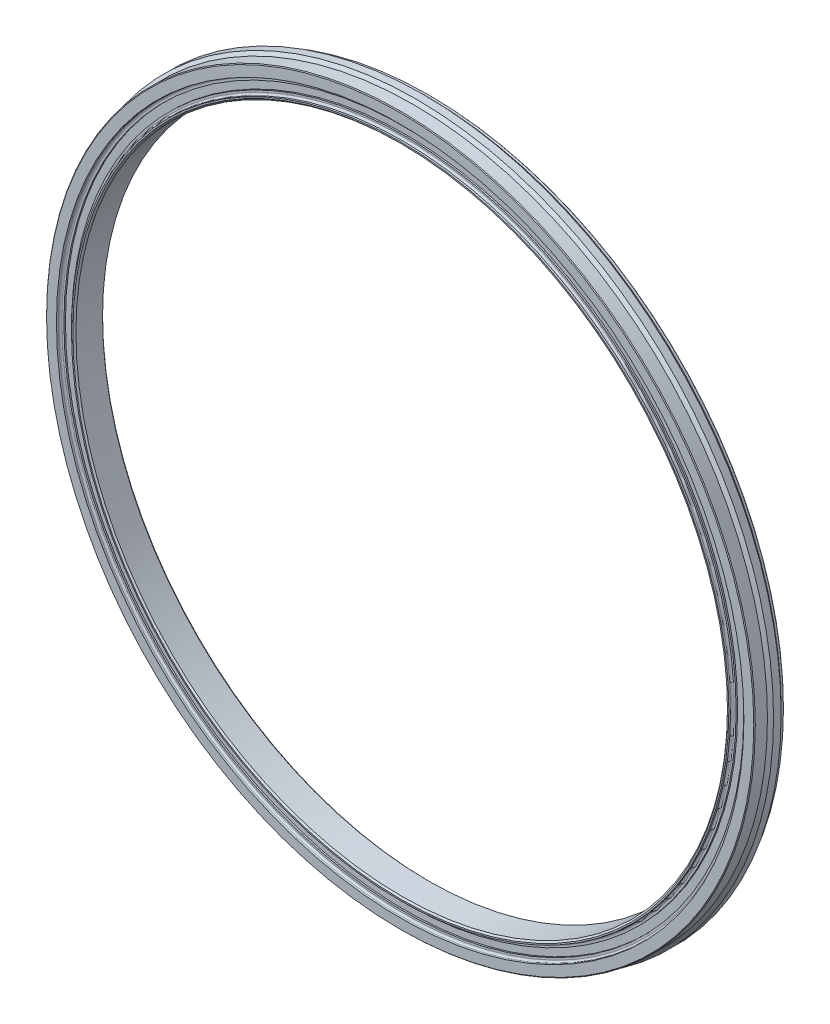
ISO-10303-21;
HEADER;
FILE_DESCRIPTION(('STEP AP214'),'2;1');
FILE_NAME('part.step','',(''),(''),'','','');
FILE_SCHEMA(('AUTOMOTIVE_DESIGN { 1 0 10303 214 1 1 1 1 }'));
ENDSEC;
DATA;
#1=APPLICATION_CONTEXT('core data for automotive mechanical design processes');
#2=APPLICATION_PROTOCOL_DEFINITION('international standard','automotive_design',2000,#1);
#3=PRODUCT_CONTEXT('',#1,'mechanical');
#4=PRODUCT('Part','Part','',(#3));
#5=PRODUCT_RELATED_PRODUCT_CATEGORY('part','',(#4));
#6=PRODUCT_DEFINITION_FORMATION('','',#4);
#7=PRODUCT_DEFINITION_CONTEXT('part definition',#1,'design');
#8=PRODUCT_DEFINITION('design','',#6,#7);
#9=PRODUCT_DEFINITION_SHAPE('','',#8);
#10=(LENGTH_UNIT() NAMED_UNIT(*) SI_UNIT(.MILLI.,.METRE.));
#11=(NAMED_UNIT(*) PLANE_ANGLE_UNIT() SI_UNIT($,.RADIAN.));
#12=(NAMED_UNIT(*) SI_UNIT($,.STERADIAN.) SOLID_ANGLE_UNIT());
#13=UNCERTAINTY_MEASURE_WITH_UNIT(LENGTH_MEASURE(1.E-05),#10,'distance_accuracy_value','');
#14=(GEOMETRIC_REPRESENTATION_CONTEXT(3) GLOBAL_UNCERTAINTY_ASSIGNED_CONTEXT((#13)) GLOBAL_UNIT_ASSIGNED_CONTEXT((#10,
#11,#12)) REPRESENTATION_CONTEXT('',''));
#15=CARTESIAN_POINT('',(0.,0.,0.));
#16=DIRECTION('',(0.,0.,1.));
#17=DIRECTION('',(1.,0.,0.));
#18=AXIS2_PLACEMENT_3D('',#15,#16,#17);
#19=CARTESIAN_POINT('',(0.,0.,17.1));
#20=DIRECTION('',(0.,0.,1.));
#21=DIRECTION('',(1.,0.,0.));
#22=AXIS2_PLACEMENT_3D('',#19,#20,#21);
#23=PLANE('',#22);
#24=CARTESIAN_POINT('',(0.,0.,17.0999999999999));
#25=DIRECTION('',(0.,0.,-1.));
#26=DIRECTION('',(1.,0.,0.));
#27=AXIS2_PLACEMENT_3D('',#24,#25,#26);
#28=CIRCLE('',#27,224.8);
#29=CARTESIAN_POINT('',(-224.8,0.,17.0999999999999));
#30=VERTEX_POINT('',#29);
#31=CARTESIAN_POINT('',(224.8,0.,17.0999999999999));
#32=VERTEX_POINT('',#31);
#33=EDGE_CURVE('E82',#30,#32,#28,.F.);
#34=ORIENTED_EDGE('',*,*,#33,.T.);
#35=CARTESIAN_POINT('',(0.,0.,17.0999999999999));
#36=DIRECTION('',(0.,0.,-1.));
#37=DIRECTION('',(-1.,0.,0.));
#38=AXIS2_PLACEMENT_3D('',#35,#36,#37);
#39=CIRCLE('',#38,224.8);
#40=EDGE_CURVE('E79',#32,#30,#39,.F.);
#41=ORIENTED_EDGE('',*,*,#40,.T.);
#42=EDGE_LOOP('',(#34,#41));
#43=FACE_BOUND('',#42,.T.);
#44=CARTESIAN_POINT('',(0.,0.,17.1));
#45=DIRECTION('',(0.,0.,1.));
#46=DIRECTION('',(1.,0.,0.));
#47=AXIS2_PLACEMENT_3D('',#44,#45,#46);
#48=CIRCLE('',#47,223.5);
#49=CARTESIAN_POINT('',(223.5,0.,17.1));
#50=VERTEX_POINT('',#49);
#51=EDGE_CURVE('E86',#50,#50,#48,.F.);
#52=ORIENTED_EDGE('',*,*,#51,.T.);
#53=EDGE_LOOP('',(#52));
#54=FACE_BOUND('',#53,.T.);
#55=ADVANCED_FACE('F16',(#43,#54),#23,.T.);
#56=CARTESIAN_POINT('',(0.,0.,-0.975000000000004));
#57=DIRECTION('',(0.,0.,1.));
#58=DIRECTION('',(1.,0.,0.));
#59=AXIS2_PLACEMENT_3D('',#56,#57,#58);
#60=CYLINDRICAL_SURFACE('',#59,223.5);
#61=ORIENTED_EDGE('',*,*,#51,.F.);
#62=EDGE_LOOP('',(#61));
#63=FACE_BOUND('',#62,.T.);
#64=CARTESIAN_POINT('',(0.,0.,16.1));
#65=DIRECTION('',(0.,0.,1.));
#66=DIRECTION('',(1.,0.,0.));
#67=AXIS2_PLACEMENT_3D('',#64,#65,#66);
#68=CIRCLE('',#67,223.5);
#69=CARTESIAN_POINT('',(223.5,0.,16.1));
#70=VERTEX_POINT('',#69);
#71=EDGE_CURVE('E91',#70,#70,#68,.T.);
#72=ORIENTED_EDGE('',*,*,#71,.F.);
#73=EDGE_LOOP('',(#72));
#74=FACE_BOUND('',#73,.T.);
#75=ADVANCED_FACE('F117',(#63,#74),#60,.F.);
#76=CARTESIAN_POINT('',(0.,0.,18.2999999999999));
#77=DIRECTION('',(0.,0.,1.));
#78=DIRECTION('',(-1.,0.,0.));
#79=AXIS2_PLACEMENT_3D('',#76,#77,#78);
#80=TOROIDAL_SURFACE('',#79,224.8,1.2);
#81=CARTESIAN_POINT('',(0.,0.,18.3));
#82=DIRECTION('',(0.,0.,1.));
#83=DIRECTION('',(1.,0.,0.));
#84=AXIS2_PLACEMENT_3D('',#81,#82,#83);
#85=CIRCLE('',#84,226.);
#86=CARTESIAN_POINT('',(226.,0.,18.3));
#87=VERTEX_POINT('',#86);
#88=EDGE_CURVE('E123',#87,#87,#85,.T.);
#89=ORIENTED_EDGE('',*,*,#88,.T.);
#90=EDGE_LOOP('',(#89));
#91=FACE_BOUND('',#90,.T.);
#92=ORIENTED_EDGE('',*,*,#33,.F.);
#93=ORIENTED_EDGE('',*,*,#40,.F.);
#94=EDGE_LOOP('',(#92,#93));
#95=FACE_BOUND('',#94,.T.);
#96=ADVANCED_FACE('F83',(#91,#95),#80,.F.);
#97=CARTESIAN_POINT('',(0.,0.,16.1));
#98=DIRECTION('',(0.,0.,1.));
#99=DIRECTION('',(1.,0.,0.));
#100=AXIS2_PLACEMENT_3D('',#97,#98,#99);
#101=PLANE('',#100);
#102=ORIENTED_EDGE('',*,*,#71,.T.);
#103=EDGE_LOOP('',(#102));
#104=FACE_BOUND('',#103,.T.);
#105=CARTESIAN_POINT('',(0.,0.,16.1));
#106=DIRECTION('',(0.,0.,1.));
#107=DIRECTION('',(1.,0.,0.));
#108=AXIS2_PLACEMENT_3D('',#105,#106,#107);
#109=CIRCLE('',#108,218.5);
#110=CARTESIAN_POINT('',(218.5,0.,16.1));
#111=VERTEX_POINT('',#110);
#112=EDGE_CURVE('E127',#111,#111,#109,.T.);
#113=ORIENTED_EDGE('',*,*,#112,.F.);
#114=EDGE_LOOP('',(#113));
#115=FACE_BOUND('',#114,.T.);
#116=ADVANCED_FACE('F116',(#104,#115),#101,.T.);
#117=CARTESIAN_POINT('',(0.,0.,-0.975000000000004));
#118=DIRECTION('',(0.,0.,1.));
#119=DIRECTION('',(1.,0.,0.));
#120=AXIS2_PLACEMENT_3D('',#117,#118,#119);
#121=CYLINDRICAL_SURFACE('',#120,226.);
#122=ORIENTED_EDGE('',*,*,#88,.F.);
#123=EDGE_LOOP('',(#122));
#124=FACE_BOUND('',#123,.T.);
#125=CARTESIAN_POINT('',(0.,0.,19.5));
#126=DIRECTION('',(0.,0.,1.));
#127=DIRECTION('',(1.,0.,0.));
#128=AXIS2_PLACEMENT_3D('',#125,#126,#127);
#129=CIRCLE('',#128,226.);
#130=CARTESIAN_POINT('',(226.,0.,19.5));
#131=VERTEX_POINT('',#130);
#132=EDGE_CURVE('E379',#131,#131,#129,.F.);
#133=ORIENTED_EDGE('',*,*,#132,.F.);
#134=EDGE_LOOP('',(#133));
#135=FACE_BOUND('',#134,.T.);
#136=ADVANCED_FACE('F192',(#124,#135),#121,.F.);
#137=CARTESIAN_POINT('',(0.,0.,-0.975000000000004));
#138=DIRECTION('',(0.,0.,1.));
#139=DIRECTION('',(1.,0.,0.));
#140=AXIS2_PLACEMENT_3D('',#137,#138,#139);
#141=CYLINDRICAL_SURFACE('',#140,218.5);
#142=ORIENTED_EDGE('',*,*,#112,.T.);
#143=EDGE_LOOP('',(#142));
#144=FACE_BOUND('',#143,.T.);
#145=CARTESIAN_POINT('',(0.,0.,17.1));
#146=DIRECTION('',(0.,0.,1.));
#147=DIRECTION('',(1.,0.,0.));
#148=AXIS2_PLACEMENT_3D('',#145,#146,#147);
#149=CIRCLE('',#148,218.5);
#150=CARTESIAN_POINT('',(218.5,0.,17.1));
#151=VERTEX_POINT('',#150);
#152=EDGE_CURVE('E375',#151,#151,#149,.T.);
#153=ORIENTED_EDGE('',*,*,#152,.F.);
#154=EDGE_LOOP('',(#153));
#155=FACE_BOUND('',#154,.T.);
#156=ADVANCED_FACE('F189',(#144,#155),#141,.T.);
#157=CARTESIAN_POINT('',(0.,0.,19.5));
#158=DIRECTION('',(0.,0.,1.));
#159=DIRECTION('',(1.,0.,0.));
#160=AXIS2_PLACEMENT_3D('',#157,#158,#159);
#161=PLANE('',#160);
#162=CARTESIAN_POINT('',(0.,0.,19.5));
#163=DIRECTION('',(0.,0.,-1.));
#164=DIRECTION('',(-1.,0.,0.));
#165=AXIS2_PLACEMENT_3D('',#162,#163,#164);
#166=CIRCLE('',#165,232.5);
#167=CARTESIAN_POINT('',(-232.5,0.,19.5));
#168=VERTEX_POINT('',#167);
#169=EDGE_CURVE('E371',#168,#168,#166,.T.);
#170=ORIENTED_EDGE('',*,*,#169,.F.);
#171=EDGE_LOOP('',(#170));
#172=FACE_BOUND('',#171,.T.);
#173=ORIENTED_EDGE('',*,*,#132,.T.);
#174=EDGE_LOOP('',(#173));
#175=FACE_BOUND('',#174,.T.);
#176=ADVANCED_FACE('F177',(#172,#175),#161,.T.);
#177=CARTESIAN_POINT('',(0.,0.,17.1));
#178=DIRECTION('',(0.,0.,1.));
#179=DIRECTION('',(1.,0.,0.));
#180=AXIS2_PLACEMENT_3D('',#177,#178,#179);
#181=PLANE('',#180);
#182=ORIENTED_EDGE('',*,*,#152,.T.);
#183=EDGE_LOOP('',(#182));
#184=FACE_BOUND('',#183,.T.);
#185=CARTESIAN_POINT('',(0.,0.,17.0999999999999));
#186=DIRECTION('',(0.,0.,1.));
#187=DIRECTION('',(1.,0.,0.));
#188=AXIS2_PLACEMENT_3D('',#185,#186,#187);
#189=CIRCLE('',#188,217.3);
#190=CARTESIAN_POINT('',(-217.3,0.,17.0999999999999));
#191=VERTEX_POINT('',#190);
#192=CARTESIAN_POINT('',(217.3,0.,17.0999999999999));
#193=VERTEX_POINT('',#192);
#194=EDGE_CURVE('E164',#191,#193,#189,.F.);
#195=ORIENTED_EDGE('',*,*,#194,.T.);
#196=CARTESIAN_POINT('',(0.,0.,17.0999999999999));
#197=DIRECTION('',(0.,0.,1.));
#198=DIRECTION('',(-1.,0.,0.));
#199=AXIS2_PLACEMENT_3D('',#196,#197,#198);
#200=CIRCLE('',#199,217.3);
#201=EDGE_CURVE('E160',#193,#191,#200,.F.);
#202=ORIENTED_EDGE('',*,*,#201,.T.);
#203=EDGE_LOOP('',(#195,#202));
#204=FACE_BOUND('',#203,.T.);
#205=ADVANCED_FACE('F168',(#184,#204),#181,.T.);
#206=CARTESIAN_POINT('',(0.,0.,19.));
#207=DIRECTION('',(0.,0.,-1.));
#208=DIRECTION('',(-1.,0.,0.));
#209=AXIS2_PLACEMENT_3D('',#206,#207,#208);
#210=CONICAL_SURFACE('',#209,233.,0.785398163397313);
#211=CARTESIAN_POINT('',(0.,0.,19.));
#212=DIRECTION('',(0.,0.,1.));
#213=DIRECTION('',(1.,0.,0.));
#214=AXIS2_PLACEMENT_3D('',#211,#212,#213);
#215=CIRCLE('',#214,233.);
#216=CARTESIAN_POINT('',(233.,0.,19.));
#217=VERTEX_POINT('',#216);
#218=EDGE_CURVE('E156',#217,#217,#215,.F.);
#219=ORIENTED_EDGE('',*,*,#218,.F.);
#220=EDGE_LOOP('',(#219));
#221=FACE_BOUND('',#220,.T.);
#222=ORIENTED_EDGE('',*,*,#169,.T.);
#223=EDGE_LOOP('',(#222));
#224=FACE_BOUND('',#223,.T.);
#225=ADVANCED_FACE('F146',(#221,#224),#210,.T.);
#226=CARTESIAN_POINT('',(0.,0.,18.2999999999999));
#227=DIRECTION('',(0.,0.,1.));
#228=DIRECTION('',(-1.,0.,0.));
#229=AXIS2_PLACEMENT_3D('',#226,#227,#228);
#230=TOROIDAL_SURFACE('',#229,217.3,1.2);
#231=CARTESIAN_POINT('',(0.,0.,18.3));
#232=DIRECTION('',(0.,0.,1.));
#233=DIRECTION('',(1.,0.,0.));
#234=AXIS2_PLACEMENT_3D('',#231,#232,#233);
#235=CIRCLE('',#234,216.1);
#236=CARTESIAN_POINT('',(216.1,0.,18.3));
#237=VERTEX_POINT('',#236);
#238=EDGE_CURVE('E154',#237,#237,#235,.T.);
#239=ORIENTED_EDGE('',*,*,#238,.F.);
#240=EDGE_LOOP('',(#239));
#241=FACE_BOUND('',#240,.T.);
#242=ORIENTED_EDGE('',*,*,#201,.F.);
#243=ORIENTED_EDGE('',*,*,#194,.F.);
#244=EDGE_LOOP('',(#242,#243));
#245=FACE_BOUND('',#244,.T.);
#246=ADVANCED_FACE('F134',(#241,#245),#230,.F.);
#247=CARTESIAN_POINT('',(0.,0.,-0.975000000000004));
#248=DIRECTION('',(0.,0.,1.));
#249=DIRECTION('',(1.,0.,0.));
#250=AXIS2_PLACEMENT_3D('',#247,#248,#249);
#251=CYLINDRICAL_SURFACE('',#250,233.);
#252=ORIENTED_EDGE('',*,*,#218,.T.);
#253=EDGE_LOOP('',(#252));
#254=FACE_BOUND('',#253,.T.);
#255=CARTESIAN_POINT('',(0.,0.,11.0000000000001));
#256=DIRECTION('',(0.,0.,-1.));
#257=DIRECTION('',(-1.,0.,0.));
#258=AXIS2_PLACEMENT_3D('',#255,#256,#257);
#259=CIRCLE('',#258,233.);
#260=CARTESIAN_POINT('',(-233.,0.,11.0000000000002));
#261=VERTEX_POINT('',#260);
#262=EDGE_CURVE('E357',#261,#261,#259,.T.);
#263=ORIENTED_EDGE('',*,*,#262,.F.);
#264=EDGE_LOOP('',(#263));
#265=FACE_BOUND('',#264,.T.);
#266=ADVANCED_FACE('F145',(#254,#265),#251,.T.);
#267=CARTESIAN_POINT('',(0.,0.,-0.975000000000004));
#268=DIRECTION('',(0.,0.,1.));
#269=DIRECTION('',(1.,0.,0.));
#270=AXIS2_PLACEMENT_3D('',#267,#268,#269);
#271=CYLINDRICAL_SURFACE('',#270,216.1);
#272=ORIENTED_EDGE('',*,*,#238,.T.);
#273=EDGE_LOOP('',(#272));
#274=FACE_BOUND('',#273,.T.);
#275=CARTESIAN_POINT('',(0.,0.,19.5));
#276=DIRECTION('',(0.,0.,1.));
#277=DIRECTION('',(1.,0.,0.));
#278=AXIS2_PLACEMENT_3D('',#275,#276,#277);
#279=CIRCLE('',#278,216.1);
#280=CARTESIAN_POINT('',(216.1,0.,19.5));
#281=VERTEX_POINT('',#280);
#282=EDGE_CURVE('E354',#281,#281,#279,.T.);
#283=ORIENTED_EDGE('',*,*,#282,.F.);
#284=EDGE_LOOP('',(#283));
#285=FACE_BOUND('',#284,.T.);
#286=ADVANCED_FACE('F341',(#274,#285),#271,.T.);
#287=CARTESIAN_POINT('',(0.,0.,9.00000000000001));
#288=DIRECTION('',(0.,0.,-1.));
#289=DIRECTION('',(-1.,0.,0.));
#290=AXIS2_PLACEMENT_3D('',#287,#288,#289);
#291=CONICAL_SURFACE('',#290,235.,0.785398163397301);
#292=CARTESIAN_POINT('',(0.,0.,9.00000000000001));
#293=DIRECTION('',(0.,0.,1.));
#294=DIRECTION('',(1.,0.,0.));
#295=AXIS2_PLACEMENT_3D('',#292,#293,#294);
#296=CIRCLE('',#295,235.);
#297=CARTESIAN_POINT('',(235.,0.,9.00000000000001));
#298=VERTEX_POINT('',#297);
#299=EDGE_CURVE('E356',#298,#298,#296,.F.);
#300=ORIENTED_EDGE('',*,*,#299,.F.);
#301=EDGE_LOOP('',(#300));
#302=FACE_BOUND('',#301,.T.);
#303=ORIENTED_EDGE('',*,*,#262,.T.);
#304=EDGE_LOOP('',(#303));
#305=FACE_BOUND('',#304,.T.);
#306=ADVANCED_FACE('F338',(#302,#305),#291,.T.);
#307=CARTESIAN_POINT('',(0.,0.,19.5));
#308=DIRECTION('',(0.,0.,1.));
#309=DIRECTION('',(1.,0.,0.));
#310=AXIS2_PLACEMENT_3D('',#307,#308,#309);
#311=PLANE('',#310);
#312=ORIENTED_EDGE('',*,*,#282,.T.);
#313=EDGE_LOOP('',(#312));
#314=FACE_BOUND('',#313,.T.);
#315=CARTESIAN_POINT('',(0.,0.,19.5000000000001));
#316=DIRECTION('',(0.,0.,1.));
#317=DIRECTION('',(0.,-1.,0.));
#318=AXIS2_PLACEMENT_3D('',#315,#316,#317);
#319=CIRCLE('',#318,215.2);
#320=CARTESIAN_POINT('',(0.,-215.2,19.5000000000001));
#321=VERTEX_POINT('',#320);
#322=EDGE_CURVE('E364',#321,#321,#319,.F.);
#323=ORIENTED_EDGE('',*,*,#322,.T.);
#324=EDGE_LOOP('',(#323));
#325=FACE_BOUND('',#324,.T.);
#326=ADVANCED_FACE('F334',(#314,#325),#311,.T.);
#327=CARTESIAN_POINT('',(0.,0.,-0.975000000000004));
#328=DIRECTION('',(0.,0.,1.));
#329=DIRECTION('',(1.,0.,0.));
#330=AXIS2_PLACEMENT_3D('',#327,#328,#329);
#331=CYLINDRICAL_SURFACE('',#330,235.);
#332=ORIENTED_EDGE('',*,*,#299,.T.);
#333=EDGE_LOOP('',(#332));
#334=FACE_BOUND('',#333,.T.);
#335=CARTESIAN_POINT('',(0.,0.,4.00000000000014));
#336=DIRECTION('',(0.,0.,1.));
#337=DIRECTION('',(1.,0.,0.));
#338=AXIS2_PLACEMENT_3D('',#335,#336,#337);
#339=CIRCLE('',#338,235.);
#340=CARTESIAN_POINT('',(235.,0.,4.00000000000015));
#341=VERTEX_POINT('',#340);
#342=EDGE_CURVE('E421',#341,#341,#339,.F.);
#343=ORIENTED_EDGE('',*,*,#342,.F.);
#344=EDGE_LOOP('',(#343));
#345=FACE_BOUND('',#344,.T.);
#346=ADVANCED_FACE('F330',(#334,#345),#331,.T.);
#347=CARTESIAN_POINT('',(0.,0.,19.5000000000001));
#348=DIRECTION('',(0.,0.,1.));
#349=DIRECTION('',(0.,-1.,0.));
#350=AXIS2_PLACEMENT_3D('',#347,#348,#349);
#351=CONICAL_SURFACE('',#350,215.2,0.785398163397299);
#352=CARTESIAN_POINT('',(0.,0.,18.5));
#353=DIRECTION('',(0.,0.,1.));
#354=DIRECTION('',(1.,0.,0.));
#355=AXIS2_PLACEMENT_3D('',#352,#353,#354);
#356=CIRCLE('',#355,214.2);
#357=CARTESIAN_POINT('',(214.2,0.,18.5));
#358=VERTEX_POINT('',#357);
#359=EDGE_CURVE('E407',#358,#358,#356,.F.);
#360=ORIENTED_EDGE('',*,*,#359,.T.);
#361=EDGE_LOOP('',(#360));
#362=FACE_BOUND('',#361,.T.);
#363=ORIENTED_EDGE('',*,*,#322,.F.);
#364=EDGE_LOOP('',(#363));
#365=FACE_BOUND('',#364,.T.);
#366=ADVANCED_FACE('F326',(#362,#365),#351,.F.);
#367=CARTESIAN_POINT('',(0.,0.,4.00000000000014));
#368=DIRECTION('',(0.,0.,1.));
#369=DIRECTION('',(1.,0.,0.));
#370=AXIS2_PLACEMENT_3D('',#367,#368,#369);
#371=CONICAL_SURFACE('',#370,235.,0.785398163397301);
#372=ORIENTED_EDGE('',*,*,#342,.T.);
#373=EDGE_LOOP('',(#372));
#374=FACE_BOUND('',#373,.T.);
#375=CARTESIAN_POINT('',(0.,0.,2.));
#376=DIRECTION('',(0.,0.,1.));
#377=DIRECTION('',(1.,0.,0.));
#378=AXIS2_PLACEMENT_3D('',#375,#376,#377);
#379=CIRCLE('',#378,233.);
#380=CARTESIAN_POINT('',(233.,0.,2.));
#381=VERTEX_POINT('',#380);
#382=EDGE_CURVE('E403',#381,#381,#379,.F.);
#383=ORIENTED_EDGE('',*,*,#382,.F.);
#384=EDGE_LOOP('',(#383));
#385=FACE_BOUND('',#384,.T.);
#386=ADVANCED_FACE('F322',(#374,#385),#371,.T.);
#387=CARTESIAN_POINT('',(194.8557158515,-112.5,12.4978484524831));
#388=DIRECTION('',(0.,0.,-1.));
#389=DIRECTION('',(-1.,0.,0.));
#390=AXIS2_PLACEMENT_3D('',#387,#388,#389);
#391=CONICAL_SURFACE('',#390,2.49999999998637,1.02974425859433);
#392=CARTESIAN_POINT('',(194.8557158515,-112.5,14.0000000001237));
#393=VERTEX_POINT('',#392);
#394=VERTEX_LOOP('',#393);
#395=FACE_BOUND('',#394,.T.);
#396=CARTESIAN_POINT('',(194.8557158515,-112.5,12.49784845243));
#397=DIRECTION('',(0.,0.,-1.));
#398=DIRECTION('',(-1.,0.,0.));
#399=AXIS2_PLACEMENT_3D('',#396,#397,#398);
#400=CIRCLE('',#399,2.5);
#401=CARTESIAN_POINT('',(192.3557158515,-112.5,12.49784845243));
#402=VERTEX_POINT('',#401);
#403=EDGE_CURVE('E406',#402,#402,#400,.T.);
#404=ORIENTED_EDGE('',*,*,#403,.T.);
#405=EDGE_LOOP('',(#404));
#406=FACE_BOUND('',#405,.T.);
#407=ADVANCED_FACE('F318',(#395,#406),#391,.F.);
#408=CARTESIAN_POINT('',(112.5,-194.8557158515,12.4978484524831));
#409=DIRECTION('',(0.,0.,-1.));
#410=DIRECTION('',(0.,1.,0.));
#411=AXIS2_PLACEMENT_3D('',#408,#409,#410);
#412=CONICAL_SURFACE('',#411,2.49999999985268,1.02974425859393);
#413=CARTESIAN_POINT('',(112.5,-194.8557158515,14.0000000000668));
#414=VERTEX_POINT('',#413);
#415=VERTEX_LOOP('',#414);
#416=FACE_BOUND('',#415,.T.);
#417=CARTESIAN_POINT('',(112.5,-194.8557158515,12.49784845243));
#418=DIRECTION('',(0.,0.,-1.));
#419=DIRECTION('',(-1.,0.,0.));
#420=AXIS2_PLACEMENT_3D('',#417,#418,#419);
#421=CIRCLE('',#420,2.5);
#422=CARTESIAN_POINT('',(110.,-194.8557158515,12.49784845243));
#423=VERTEX_POINT('',#422);
#424=EDGE_CURVE('E510',#423,#423,#421,.T.);
#425=ORIENTED_EDGE('',*,*,#424,.T.);
#426=EDGE_LOOP('',(#425));
#427=FACE_BOUND('',#426,.T.);
#428=ADVANCED_FACE('F314',(#416,#427),#412,.F.);
#429=CARTESIAN_POINT('',(0.,-225.,12.49784845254));
#430=DIRECTION('',(0.,0.,-1.));
#431=DIRECTION('',(0.,1.,0.));
#432=AXIS2_PLACEMENT_3D('',#429,#430,#431);
#433=CONICAL_SURFACE('',#432,2.49999999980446,1.0297442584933);
#434=CARTESIAN_POINT('',(0.,-225.,14.0000000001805));
#435=VERTEX_POINT('',#434);
#436=VERTEX_LOOP('',#435);
#437=FACE_BOUND('',#436,.T.);
#438=CARTESIAN_POINT('',(0.,-225.,12.49784845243));
#439=DIRECTION('',(0.,0.,-1.));
#440=DIRECTION('',(-1.,0.,0.));
#441=AXIS2_PLACEMENT_3D('',#438,#439,#440);
#442=CIRCLE('',#441,2.5);
#443=CARTESIAN_POINT('',(-2.5,-225.,12.49784845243));
#444=VERTEX_POINT('',#443);
#445=EDGE_CURVE('E513',#444,#444,#442,.T.);
#446=ORIENTED_EDGE('',*,*,#445,.T.);
#447=EDGE_LOOP('',(#446));
#448=FACE_BOUND('',#447,.T.);
#449=ADVANCED_FACE('F310',(#437,#448),#433,.F.);
#450=CARTESIAN_POINT('',(-112.5,-194.8557158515,12.4978484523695));
#451=DIRECTION('',(0.,0.,-1.));
#452=DIRECTION('',(0.,1.,0.));
#453=AXIS2_PLACEMENT_3D('',#450,#451,#452);
#454=CONICAL_SURFACE('',#453,2.50000000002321,1.02974425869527);
#455=CARTESIAN_POINT('',(-112.5,-194.8557158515,13.9999999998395));
#456=VERTEX_POINT('',#455);
#457=VERTEX_LOOP('',#456);
#458=FACE_BOUND('',#457,.T.);
#459=CARTESIAN_POINT('',(-112.5,-194.8557158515,12.49784845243));
#460=DIRECTION('',(0.,0.,-1.));
#461=DIRECTION('',(-1.,0.,0.));
#462=AXIS2_PLACEMENT_3D('',#459,#460,#461);
#463=CIRCLE('',#462,2.5);
#464=CARTESIAN_POINT('',(-115.,-194.8557158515,12.49784845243));
#465=VERTEX_POINT('',#464);
#466=EDGE_CURVE('E516',#465,#465,#463,.T.);
#467=ORIENTED_EDGE('',*,*,#466,.T.);
#468=EDGE_LOOP('',(#467));
#469=FACE_BOUND('',#468,.T.);
#470=ADVANCED_FACE('F306',(#458,#469),#454,.F.);
#471=CARTESIAN_POINT('',(-194.8557158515,-112.5,12.4978484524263));
#472=DIRECTION('',(0.,0.,-1.));
#473=DIRECTION('',(-1.,0.,0.));
#474=AXIS2_PLACEMENT_3D('',#471,#472,#473);
#475=CONICAL_SURFACE('',#474,2.49999999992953,1.02974425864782);
#476=CARTESIAN_POINT('',(-194.8557158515,-112.5,14.00000000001));
#477=VERTEX_POINT('',#476);
#478=VERTEX_LOOP('',#477);
#479=FACE_BOUND('',#478,.T.);
#480=CARTESIAN_POINT('',(-194.8557158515,-112.5,12.49784845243));
#481=DIRECTION('',(0.,0.,-1.));
#482=DIRECTION('',(-1.,0.,0.));
#483=AXIS2_PLACEMENT_3D('',#480,#481,#482);
#484=CIRCLE('',#483,2.5);
#485=CARTESIAN_POINT('',(-197.3557158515,-112.5,12.49784845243));
#486=VERTEX_POINT('',#485);
#487=EDGE_CURVE('E519',#486,#486,#484,.T.);
#488=ORIENTED_EDGE('',*,*,#487,.T.);
#489=EDGE_LOOP('',(#488));
#490=FACE_BOUND('',#489,.T.);
#491=ADVANCED_FACE('F302',(#479,#490),#475,.F.);
#492=CARTESIAN_POINT('',(-225.,0.,12.4978484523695));
#493=DIRECTION('',(0.,0.,-1.));
#494=DIRECTION('',(0.,1.,0.));
#495=AXIS2_PLACEMENT_3D('',#492,#493,#494);
#496=CONICAL_SURFACE('',#495,2.49999999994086,1.0297442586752);
#497=CARTESIAN_POINT('',(-225.,0.,13.9999999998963));
#498=VERTEX_POINT('',#497);
#499=VERTEX_LOOP('',#498);
#500=FACE_BOUND('',#499,.T.);
#501=CARTESIAN_POINT('',(-225.,0.,12.49784845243));
#502=DIRECTION('',(0.,0.,-1.));
#503=DIRECTION('',(-1.,0.,0.));
#504=AXIS2_PLACEMENT_3D('',#501,#502,#503);
#505=CIRCLE('',#504,2.5);
#506=CARTESIAN_POINT('',(-227.5,0.,12.49784845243));
#507=VERTEX_POINT('',#506);
#508=EDGE_CURVE('E419',#507,#507,#505,.T.);
#509=ORIENTED_EDGE('',*,*,#508,.T.);
#510=EDGE_LOOP('',(#509));
#511=FACE_BOUND('',#510,.T.);
#512=ADVANCED_FACE('F298',(#500,#511),#496,.F.);
#513=CARTESIAN_POINT('',(-194.8557158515,112.5,12.4978484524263));
#514=DIRECTION('',(0.,0.,-1.));
#515=DIRECTION('',(-1.,0.,0.));
#516=AXIS2_PLACEMENT_3D('',#513,#514,#515);
#517=CONICAL_SURFACE('',#516,2.49999999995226,1.02974425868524);
#518=CARTESIAN_POINT('',(-194.8557158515,112.5,13.9999999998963));
#519=VERTEX_POINT('',#518);
#520=VERTEX_LOOP('',#519);
#521=FACE_BOUND('',#520,.T.);
#522=CARTESIAN_POINT('',(-194.8557158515,112.5,12.49784845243));
#523=DIRECTION('',(0.,0.,-1.));
#524=DIRECTION('',(-1.,0.,0.));
#525=AXIS2_PLACEMENT_3D('',#522,#523,#524);
#526=CIRCLE('',#525,2.5);
#527=CARTESIAN_POINT('',(-197.3557158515,112.5,12.49784845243));
#528=VERTEX_POINT('',#527);
#529=EDGE_CURVE('E415',#528,#528,#526,.T.);
#530=ORIENTED_EDGE('',*,*,#529,.T.);
#531=EDGE_LOOP('',(#530));
#532=FACE_BOUND('',#531,.T.);
#533=ADVANCED_FACE('F294',(#521,#532),#517,.F.);
#534=CARTESIAN_POINT('',(-112.5,194.8557158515,12.4978484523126));
#535=DIRECTION('',(0.,0.,-1.));
#536=DIRECTION('',(0.,1.,0.));
#537=AXIS2_PLACEMENT_3D('',#534,#535,#536);
#538=CONICAL_SURFACE('',#537,2.50000000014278,1.02974425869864);
#539=CARTESIAN_POINT('',(-112.5,194.8557158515,13.9999999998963));
#540=VERTEX_POINT('',#539);
#541=VERTEX_LOOP('',#540);
#542=FACE_BOUND('',#541,.T.);
#543=CARTESIAN_POINT('',(-112.5,194.8557158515,12.49784845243));
#544=DIRECTION('',(0.,0.,-1.));
#545=DIRECTION('',(-1.,0.,0.));
#546=AXIS2_PLACEMENT_3D('',#543,#544,#545);
#547=CIRCLE('',#546,2.5);
#548=CARTESIAN_POINT('',(-115.,194.8557158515,12.49784845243));
#549=VERTEX_POINT('',#548);
#550=EDGE_CURVE('E418',#549,#549,#547,.T.);
#551=ORIENTED_EDGE('',*,*,#550,.T.);
#552=EDGE_LOOP('',(#551));
#553=FACE_BOUND('',#552,.T.);
#554=ADVANCED_FACE('F290',(#542,#553),#538,.F.);
#555=CARTESIAN_POINT('',(0.,225.,12.4978484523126));
#556=DIRECTION('',(0.,0.,-1.));
#557=DIRECTION('',(0.,1.,0.));
#558=AXIS2_PLACEMENT_3D('',#555,#556,#557);
#559=CONICAL_SURFACE('',#558,2.5000000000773,1.02974425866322);
#560=CARTESIAN_POINT('',(0.,225.,13.9999999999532));
#561=VERTEX_POINT('',#560);
#562=VERTEX_LOOP('',#561);
#563=FACE_BOUND('',#562,.T.);
#564=CARTESIAN_POINT('',(0.,225.,12.49784845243));
#565=DIRECTION('',(0.,0.,-1.));
#566=DIRECTION('',(-1.,0.,0.));
#567=AXIS2_PLACEMENT_3D('',#564,#565,#566);
#568=CIRCLE('',#567,2.5);
#569=CARTESIAN_POINT('',(-2.5,225.,12.49784845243));
#570=VERTEX_POINT('',#569);
#571=EDGE_CURVE('E526',#570,#570,#568,.T.);
#572=ORIENTED_EDGE('',*,*,#571,.T.);
#573=EDGE_LOOP('',(#572));
#574=FACE_BOUND('',#573,.T.);
#575=ADVANCED_FACE('F286',(#563,#574),#559,.F.);
#576=CARTESIAN_POINT('',(112.5,194.8557158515,12.4978484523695));
#577=DIRECTION('',(0.,0.,-1.));
#578=DIRECTION('',(0.,1.,0.));
#579=AXIS2_PLACEMENT_3D('',#576,#577,#578);
#580=CONICAL_SURFACE('',#579,2.50000000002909,1.02974425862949);
#581=CARTESIAN_POINT('',(112.5,194.8557158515,14.0000000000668));
#582=VERTEX_POINT('',#581);
#583=VERTEX_LOOP('',#582);
#584=FACE_BOUND('',#583,.T.);
#585=CARTESIAN_POINT('',(112.5,194.8557158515,12.49784845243));
#586=DIRECTION('',(0.,0.,-1.));
#587=DIRECTION('',(-1.,0.,0.));
#588=AXIS2_PLACEMENT_3D('',#585,#586,#587);
#589=CIRCLE('',#588,2.5);
#590=CARTESIAN_POINT('',(110.,194.8557158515,12.49784845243));
#591=VERTEX_POINT('',#590);
#592=EDGE_CURVE('E529',#591,#591,#589,.T.);
#593=ORIENTED_EDGE('',*,*,#592,.T.);
#594=EDGE_LOOP('',(#593));
#595=FACE_BOUND('',#594,.T.);
#596=ADVANCED_FACE('F282',(#584,#595),#580,.F.);
#597=CARTESIAN_POINT('',(194.8557158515,112.5,12.4978484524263));
#598=DIRECTION('',(0.,0.,-1.));
#599=DIRECTION('',(-1.,0.,0.));
#600=AXIS2_PLACEMENT_3D('',#597,#598,#599);
#601=CONICAL_SURFACE('',#600,2.50000000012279,1.02974425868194);
#602=CARTESIAN_POINT('',(194.8557158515,112.5,14.00000000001));
#603=VERTEX_POINT('',#602);
#604=VERTEX_LOOP('',#603);
#605=FACE_BOUND('',#604,.T.);
#606=CARTESIAN_POINT('',(194.8557158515,112.5,12.49784845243));
#607=DIRECTION('',(0.,0.,-1.));
#608=DIRECTION('',(-1.,0.,0.));
#609=AXIS2_PLACEMENT_3D('',#606,#607,#608);
#610=CIRCLE('',#609,2.5);
#611=CARTESIAN_POINT('',(192.3557158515,112.5,12.49784845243));
#612=VERTEX_POINT('',#611);
#613=EDGE_CURVE('E532',#612,#612,#610,.T.);
#614=ORIENTED_EDGE('',*,*,#613,.T.);
#615=EDGE_LOOP('',(#614));
#616=FACE_BOUND('',#615,.T.);
#617=ADVANCED_FACE('F279',(#605,#616),#601,.F.);
#618=CARTESIAN_POINT('',(225.,0.,12.4978484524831));
#619=DIRECTION('',(0.,0.,-1.));
#620=DIRECTION('',(-1.,0.,0.));
#621=AXIS2_PLACEMENT_3D('',#618,#619,#620);
#622=CONICAL_SURFACE('',#621,2.49999999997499,1.02974425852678);
#623=CARTESIAN_POINT('',(224.999999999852,0.,14.0000000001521));
#624=VERTEX_POINT('',#623);
#625=VERTEX_LOOP('',#624);
#626=FACE_BOUND('',#625,.T.);
#627=CARTESIAN_POINT('',(225.,0.,12.4978484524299));
#628=DIRECTION('',(0.,0.,-1.));
#629=DIRECTION('',(-1.,0.,0.));
#630=AXIS2_PLACEMENT_3D('',#627,#628,#629);
#631=CIRCLE('',#630,2.5);
#632=CARTESIAN_POINT('',(222.5,0.,12.4978484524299));
#633=VERTEX_POINT('',#632);
#634=EDGE_CURVE('E502',#633,#633,#631,.T.);
#635=ORIENTED_EDGE('',*,*,#634,.T.);
#636=EDGE_LOOP('',(#635));
#637=FACE_BOUND('',#636,.T.);
#638=ADVANCED_FACE('F275',(#626,#637),#622,.F.);
#639=CARTESIAN_POINT('',(0.,0.,-0.975000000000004));
#640=DIRECTION('',(0.,0.,1.));
#641=DIRECTION('',(1.,0.,0.));
#642=AXIS2_PLACEMENT_3D('',#639,#640,#641);
#643=CYLINDRICAL_SURFACE('',#642,214.2);
#644=CARTESIAN_POINT('',(0.,0.,1.00000000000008));
#645=DIRECTION('',(0.,0.,-1.));
#646=DIRECTION('',(-1.,0.,0.));
#647=AXIS2_PLACEMENT_3D('',#644,#645,#646);
#648=CIRCLE('',#647,214.2);
#649=CARTESIAN_POINT('',(-214.2,0.,1.0000000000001));
#650=VERTEX_POINT('',#649);
#651=EDGE_CURVE('E413',#650,#650,#648,.T.);
#652=ORIENTED_EDGE('',*,*,#651,.T.);
#653=EDGE_LOOP('',(#652));
#654=FACE_BOUND('',#653,.T.);
#655=ORIENTED_EDGE('',*,*,#359,.F.);
#656=EDGE_LOOP('',(#655));
#657=FACE_BOUND('',#656,.T.);
#658=ADVANCED_FACE('F272',(#654,#657),#643,.F.);
#659=CARTESIAN_POINT('',(0.,0.,-0.975000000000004));
#660=DIRECTION('',(0.,0.,1.));
#661=DIRECTION('',(1.,0.,0.));
#662=AXIS2_PLACEMENT_3D('',#659,#660,#661);
#663=CYLINDRICAL_SURFACE('',#662,233.);
#664=ORIENTED_EDGE('',*,*,#382,.T.);
#665=EDGE_LOOP('',(#664));
#666=FACE_BOUND('',#665,.T.);
#667=CARTESIAN_POINT('',(0.,0.,0.500000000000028));
#668=DIRECTION('',(0.,0.,1.));
#669=DIRECTION('',(1.,0.,0.));
#670=AXIS2_PLACEMENT_3D('',#667,#668,#669);
#671=CIRCLE('',#670,233.);
#672=CARTESIAN_POINT('',(233.,0.,0.500000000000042));
#673=VERTEX_POINT('',#672);
#674=EDGE_CURVE('E409',#673,#673,#671,.F.);
#675=ORIENTED_EDGE('',*,*,#674,.F.);
#676=EDGE_LOOP('',(#675));
#677=FACE_BOUND('',#676,.T.);
#678=ADVANCED_FACE('F268',(#666,#677),#663,.T.);
#679=CARTESIAN_POINT('',(194.8557158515,-112.5,14.7));
#680=DIRECTION('',(0.,0.,-1.));
#681=DIRECTION('',(-1.,0.,0.));
#682=AXIS2_PLACEMENT_3D('',#679,#680,#681);
#683=CYLINDRICAL_SURFACE('',#682,2.5);
#684=ORIENTED_EDGE('',*,*,#403,.F.);
#685=EDGE_LOOP('',(#684));
#686=FACE_BOUND('',#685,.T.);
#687=CARTESIAN_POINT('',(194.8557158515,-112.5,0.));
#688=DIRECTION('',(0.,0.,-1.));
#689=DIRECTION('',(-1.,0.,0.));
#690=AXIS2_PLACEMENT_3D('',#687,#688,#689);
#691=CIRCLE('',#690,2.5);
#692=CARTESIAN_POINT('',(192.3557158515,-112.5,0.));
#693=VERTEX_POINT('',#692);
#694=EDGE_CURVE('E412',#693,#693,#691,.T.);
#695=ORIENTED_EDGE('',*,*,#694,.T.);
#696=EDGE_LOOP('',(#695));
#697=FACE_BOUND('',#696,.T.);
#698=ADVANCED_FACE('F264',(#686,#697),#683,.F.);
#699=CARTESIAN_POINT('',(112.5,-194.8557158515,14.7));
#700=DIRECTION('',(0.,0.,-1.));
#701=DIRECTION('',(-1.,0.,0.));
#702=AXIS2_PLACEMENT_3D('',#699,#700,#701);
#703=CYLINDRICAL_SURFACE('',#702,2.5);
#704=ORIENTED_EDGE('',*,*,#424,.F.);
#705=EDGE_LOOP('',(#704));
#706=FACE_BOUND('',#705,.T.);
#707=CARTESIAN_POINT('',(112.5,-194.8557158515,0.));
#708=DIRECTION('',(0.,0.,-1.));
#709=DIRECTION('',(-1.,0.,0.));
#710=AXIS2_PLACEMENT_3D('',#707,#708,#709);
#711=CIRCLE('',#710,2.5);
#712=CARTESIAN_POINT('',(110.,-194.8557158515,0.));
#713=VERTEX_POINT('',#712);
#714=EDGE_CURVE('E448',#713,#713,#711,.T.);
#715=ORIENTED_EDGE('',*,*,#714,.T.);
#716=EDGE_LOOP('',(#715));
#717=FACE_BOUND('',#716,.T.);
#718=ADVANCED_FACE('F260',(#706,#717),#703,.F.);
#719=CARTESIAN_POINT('',(0.,-225.,14.7));
#720=DIRECTION('',(0.,0.,-1.));
#721=DIRECTION('',(-1.,0.,0.));
#722=AXIS2_PLACEMENT_3D('',#719,#720,#721);
#723=CYLINDRICAL_SURFACE('',#722,2.5);
#724=ORIENTED_EDGE('',*,*,#445,.F.);
#725=EDGE_LOOP('',(#724));
#726=FACE_BOUND('',#725,.T.);
#727=CARTESIAN_POINT('',(0.,-225.,0.));
#728=DIRECTION('',(0.,0.,-1.));
#729=DIRECTION('',(-1.,0.,0.));
#730=AXIS2_PLACEMENT_3D('',#727,#728,#729);
#731=CIRCLE('',#730,2.5);
#732=CARTESIAN_POINT('',(-2.5,-225.,0.));
#733=VERTEX_POINT('',#732);
#734=EDGE_CURVE('E445',#733,#733,#731,.T.);
#735=ORIENTED_EDGE('',*,*,#734,.T.);
#736=EDGE_LOOP('',(#735));
#737=FACE_BOUND('',#736,.T.);
#738=ADVANCED_FACE('F256',(#726,#737),#723,.F.);
#739=CARTESIAN_POINT('',(-112.5,-194.8557158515,14.7));
#740=DIRECTION('',(0.,0.,-1.));
#741=DIRECTION('',(-1.,0.,0.));
#742=AXIS2_PLACEMENT_3D('',#739,#740,#741);
#743=CYLINDRICAL_SURFACE('',#742,2.5);
#744=ORIENTED_EDGE('',*,*,#466,.F.);
#745=EDGE_LOOP('',(#744));
#746=FACE_BOUND('',#745,.T.);
#747=CARTESIAN_POINT('',(-112.5,-194.8557158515,0.));
#748=DIRECTION('',(0.,0.,-1.));
#749=DIRECTION('',(-1.,0.,0.));
#750=AXIS2_PLACEMENT_3D('',#747,#748,#749);
#751=CIRCLE('',#750,2.5);
#752=CARTESIAN_POINT('',(-115.,-194.8557158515,0.));
#753=VERTEX_POINT('',#752);
#754=EDGE_CURVE('E442',#753,#753,#751,.T.);
#755=ORIENTED_EDGE('',*,*,#754,.T.);
#756=EDGE_LOOP('',(#755));
#757=FACE_BOUND('',#756,.T.);
#758=ADVANCED_FACE('F252',(#746,#757),#743,.F.);
#759=CARTESIAN_POINT('',(-194.8557158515,-112.5,14.7));
#760=DIRECTION('',(0.,0.,-1.));
#761=DIRECTION('',(-1.,0.,0.));
#762=AXIS2_PLACEMENT_3D('',#759,#760,#761);
#763=CYLINDRICAL_SURFACE('',#762,2.5);
#764=ORIENTED_EDGE('',*,*,#487,.F.);
#765=EDGE_LOOP('',(#764));
#766=FACE_BOUND('',#765,.T.);
#767=CARTESIAN_POINT('',(-194.8557158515,-112.5,0.));
#768=DIRECTION('',(0.,0.,-1.));
#769=DIRECTION('',(-1.,0.,0.));
#770=AXIS2_PLACEMENT_3D('',#767,#768,#769);
#771=CIRCLE('',#770,2.5);
#772=CARTESIAN_POINT('',(-197.3557158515,-112.5,0.));
#773=VERTEX_POINT('',#772);
#774=EDGE_CURVE('E436',#773,#773,#771,.T.);
#775=ORIENTED_EDGE('',*,*,#774,.T.);
#776=EDGE_LOOP('',(#775));
#777=FACE_BOUND('',#776,.T.);
#778=ADVANCED_FACE('F248',(#766,#777),#763,.F.);
#779=CARTESIAN_POINT('',(-225.,0.,14.7));
#780=DIRECTION('',(0.,0.,-1.));
#781=DIRECTION('',(-1.,0.,0.));
#782=AXIS2_PLACEMENT_3D('',#779,#780,#781);
#783=CYLINDRICAL_SURFACE('',#782,2.5);
#784=ORIENTED_EDGE('',*,*,#508,.F.);
#785=EDGE_LOOP('',(#784));
#786=FACE_BOUND('',#785,.T.);
#787=CARTESIAN_POINT('',(-225.,0.,0.));
#788=DIRECTION('',(0.,0.,-1.));
#789=DIRECTION('',(-1.,0.,0.));
#790=AXIS2_PLACEMENT_3D('',#787,#788,#789);
#791=CIRCLE('',#790,2.5);
#792=CARTESIAN_POINT('',(-227.5,0.,0.));
#793=VERTEX_POINT('',#792);
#794=EDGE_CURVE('E428',#793,#793,#791,.T.);
#795=ORIENTED_EDGE('',*,*,#794,.T.);
#796=EDGE_LOOP('',(#795));
#797=FACE_BOUND('',#796,.T.);
#798=ADVANCED_FACE('F244',(#786,#797),#783,.F.);
#799=CARTESIAN_POINT('',(-194.8557158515,112.5,14.7));
#800=DIRECTION('',(0.,0.,-1.));
#801=DIRECTION('',(-1.,0.,0.));
#802=AXIS2_PLACEMENT_3D('',#799,#800,#801);
#803=CYLINDRICAL_SURFACE('',#802,2.5);
#804=ORIENTED_EDGE('',*,*,#529,.F.);
#805=EDGE_LOOP('',(#804));
#806=FACE_BOUND('',#805,.T.);
#807=CARTESIAN_POINT('',(-194.8557158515,112.5,0.));
#808=DIRECTION('',(0.,0.,-1.));
#809=DIRECTION('',(-1.,0.,0.));
#810=AXIS2_PLACEMENT_3D('',#807,#808,#809);
#811=CIRCLE('',#810,2.5);
#812=CARTESIAN_POINT('',(-197.3557158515,112.5,0.));
#813=VERTEX_POINT('',#812);
#814=EDGE_CURVE('E425',#813,#813,#811,.T.);
#815=ORIENTED_EDGE('',*,*,#814,.T.);
#816=EDGE_LOOP('',(#815));
#817=FACE_BOUND('',#816,.T.);
#818=ADVANCED_FACE('F240',(#806,#817),#803,.F.);
#819=CARTESIAN_POINT('',(-112.5,194.8557158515,14.7));
#820=DIRECTION('',(0.,0.,-1.));
#821=DIRECTION('',(-1.,0.,0.));
#822=AXIS2_PLACEMENT_3D('',#819,#820,#821);
#823=CYLINDRICAL_SURFACE('',#822,2.5);
#824=ORIENTED_EDGE('',*,*,#550,.F.);
#825=EDGE_LOOP('',(#824));
#826=FACE_BOUND('',#825,.T.);
#827=CARTESIAN_POINT('',(-112.5,194.8557158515,0.));
#828=DIRECTION('',(0.,0.,-1.));
#829=DIRECTION('',(-1.,0.,0.));
#830=AXIS2_PLACEMENT_3D('',#827,#828,#829);
#831=CIRCLE('',#830,2.5);
#832=CARTESIAN_POINT('',(-115.,194.8557158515,0.));
#833=VERTEX_POINT('',#832);
#834=EDGE_CURVE('E427',#833,#833,#831,.T.);
#835=ORIENTED_EDGE('',*,*,#834,.T.);
#836=EDGE_LOOP('',(#835));
#837=FACE_BOUND('',#836,.T.);
#838=ADVANCED_FACE('F236',(#826,#837),#823,.F.);
#839=CARTESIAN_POINT('',(0.,225.,14.7));
#840=DIRECTION('',(0.,0.,-1.));
#841=DIRECTION('',(-1.,0.,0.));
#842=AXIS2_PLACEMENT_3D('',#839,#840,#841);
#843=CYLINDRICAL_SURFACE('',#842,2.5);
#844=ORIENTED_EDGE('',*,*,#571,.F.);
#845=EDGE_LOOP('',(#844));
#846=FACE_BOUND('',#845,.T.);
#847=CARTESIAN_POINT('',(0.,225.,0.));
#848=DIRECTION('',(0.,0.,-1.));
#849=DIRECTION('',(-1.,0.,0.));
#850=AXIS2_PLACEMENT_3D('',#847,#848,#849);
#851=CIRCLE('',#850,2.5);
#852=CARTESIAN_POINT('',(-2.5,225.,0.));
#853=VERTEX_POINT('',#852);
#854=EDGE_CURVE('E433',#853,#853,#851,.T.);
#855=ORIENTED_EDGE('',*,*,#854,.T.);
#856=EDGE_LOOP('',(#855));
#857=FACE_BOUND('',#856,.T.);
#858=ADVANCED_FACE('F232',(#846,#857),#843,.F.);
#859=CARTESIAN_POINT('',(112.5,194.8557158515,14.7));
#860=DIRECTION('',(0.,0.,-1.));
#861=DIRECTION('',(-1.,0.,0.));
#862=AXIS2_PLACEMENT_3D('',#859,#860,#861);
#863=CYLINDRICAL_SURFACE('',#862,2.5);
#864=ORIENTED_EDGE('',*,*,#592,.F.);
#865=EDGE_LOOP('',(#864));
#866=FACE_BOUND('',#865,.T.);
#867=CARTESIAN_POINT('',(112.5,194.8557158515,0.));
#868=DIRECTION('',(0.,0.,-1.));
#869=DIRECTION('',(-1.,0.,0.));
#870=AXIS2_PLACEMENT_3D('',#867,#868,#869);
#871=CIRCLE('',#870,2.5);
#872=CARTESIAN_POINT('',(110.,194.8557158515,0.));
#873=VERTEX_POINT('',#872);
#874=EDGE_CURVE('E468',#873,#873,#871,.T.);
#875=ORIENTED_EDGE('',*,*,#874,.T.);
#876=EDGE_LOOP('',(#875));
#877=FACE_BOUND('',#876,.T.);
#878=ADVANCED_FACE('F228',(#866,#877),#863,.F.);
#879=CARTESIAN_POINT('',(194.8557158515,112.5,14.7));
#880=DIRECTION('',(0.,0.,-1.));
#881=DIRECTION('',(-1.,0.,0.));
#882=AXIS2_PLACEMENT_3D('',#879,#880,#881);
#883=CYLINDRICAL_SURFACE('',#882,2.5);
#884=ORIENTED_EDGE('',*,*,#613,.F.);
#885=EDGE_LOOP('',(#884));
#886=FACE_BOUND('',#885,.T.);
#887=CARTESIAN_POINT('',(194.8557158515,112.5,0.));
#888=DIRECTION('',(0.,0.,-1.));
#889=DIRECTION('',(-1.,0.,0.));
#890=AXIS2_PLACEMENT_3D('',#887,#888,#889);
#891=CIRCLE('',#890,2.5);
#892=CARTESIAN_POINT('',(192.3557158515,112.5,0.));
#893=VERTEX_POINT('',#892);
#894=EDGE_CURVE('E471',#893,#893,#891,.T.);
#895=ORIENTED_EDGE('',*,*,#894,.T.);
#896=EDGE_LOOP('',(#895));
#897=FACE_BOUND('',#896,.T.);
#898=ADVANCED_FACE('F224',(#886,#897),#883,.F.);
#899=CARTESIAN_POINT('',(225.,0.,14.6999999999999));
#900=DIRECTION('',(0.,0.,-1.));
#901=DIRECTION('',(-1.,0.,0.));
#902=AXIS2_PLACEMENT_3D('',#899,#900,#901);
#903=CYLINDRICAL_SURFACE('',#902,2.5);
#904=ORIENTED_EDGE('',*,*,#634,.F.);
#905=EDGE_LOOP('',(#904));
#906=FACE_BOUND('',#905,.T.);
#907=CARTESIAN_POINT('',(225.,0.,0.));
#908=DIRECTION('',(0.,0.,-1.));
#909=DIRECTION('',(-1.,0.,0.));
#910=AXIS2_PLACEMENT_3D('',#907,#908,#909);
#911=CIRCLE('',#910,2.5);
#912=CARTESIAN_POINT('',(222.5,0.,0.));
#913=VERTEX_POINT('',#912);
#914=EDGE_CURVE('E474',#913,#913,#911,.T.);
#915=ORIENTED_EDGE('',*,*,#914,.T.);
#916=EDGE_LOOP('',(#915));
#917=FACE_BOUND('',#916,.T.);
#918=ADVANCED_FACE('F220',(#906,#917),#903,.F.);
#919=CARTESIAN_POINT('',(0.,0.,0.));
#920=DIRECTION('',(0.,0.,-1.));
#921=DIRECTION('',(-1.,0.,0.));
#922=AXIS2_PLACEMENT_3D('',#919,#920,#921);
#923=CONICAL_SURFACE('',#922,215.2,0.785398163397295);
#924=ORIENTED_EDGE('',*,*,#651,.F.);
#925=EDGE_LOOP('',(#924));
#926=FACE_BOUND('',#925,.T.);
#927=CARTESIAN_POINT('',(0.,0.,0.));
#928=DIRECTION('',(0.,0.,-1.));
#929=DIRECTION('',(-1.,0.,0.));
#930=AXIS2_PLACEMENT_3D('',#927,#928,#929);
#931=CIRCLE('',#930,215.2);
#932=CARTESIAN_POINT('',(-215.2,0.,0.));
#933=VERTEX_POINT('',#932);
#934=EDGE_CURVE('E29',#933,#933,#931,.T.);
#935=ORIENTED_EDGE('',*,*,#934,.T.);
#936=EDGE_LOOP('',(#935));
#937=FACE_BOUND('',#936,.T.);
#938=ADVANCED_FACE('F212',(#926,#937),#923,.F.);
#939=CARTESIAN_POINT('',(0.,0.,0.500000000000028));
#940=DIRECTION('',(0.,0.,1.));
#941=DIRECTION('',(1.,0.,0.));
#942=AXIS2_PLACEMENT_3D('',#939,#940,#941);
#943=CONICAL_SURFACE('',#942,233.,0.785398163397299);
#944=ORIENTED_EDGE('',*,*,#674,.T.);
#945=EDGE_LOOP('',(#944));
#946=FACE_BOUND('',#945,.T.);
#947=CARTESIAN_POINT('',(0.,0.,0.));
#948=DIRECTION('',(0.,0.,1.));
#949=DIRECTION('',(1.,0.,0.));
#950=AXIS2_PLACEMENT_3D('',#947,#948,#949);
#951=CIRCLE('',#950,232.5);
#952=CARTESIAN_POINT('',(232.5,0.,0.));
#953=VERTEX_POINT('',#952);
#954=EDGE_CURVE('E11',#953,#953,#951,.T.);
#955=ORIENTED_EDGE('',*,*,#954,.T.);
#956=EDGE_LOOP('',(#955));
#957=FACE_BOUND('',#956,.T.);
#958=ADVANCED_FACE('F205',(#946,#957),#943,.T.);
#959=CARTESIAN_POINT('',(0.,0.,0.));
#960=DIRECTION('',(0.,0.,1.));
#961=DIRECTION('',(1.,0.,0.));
#962=AXIS2_PLACEMENT_3D('',#959,#960,#961);
#963=PLANE('',#962);
#964=ORIENTED_EDGE('',*,*,#954,.F.);
#965=EDGE_LOOP('',(#964));
#966=FACE_BOUND('',#965,.T.);
#967=ORIENTED_EDGE('',*,*,#934,.F.);
#968=EDGE_LOOP('',(#967));
#969=FACE_BOUND('',#968,.T.);
#970=ORIENTED_EDGE('',*,*,#914,.F.);
#971=EDGE_LOOP('',(#970));
#972=FACE_BOUND('',#971,.T.);
#973=ORIENTED_EDGE('',*,*,#894,.F.);
#974=EDGE_LOOP('',(#973));
#975=FACE_BOUND('',#974,.T.);
#976=ORIENTED_EDGE('',*,*,#874,.F.);
#977=EDGE_LOOP('',(#976));
#978=FACE_BOUND('',#977,.T.);
#979=ORIENTED_EDGE('',*,*,#854,.F.);
#980=EDGE_LOOP('',(#979));
#981=FACE_BOUND('',#980,.T.);
#982=ORIENTED_EDGE('',*,*,#834,.F.);
#983=EDGE_LOOP('',(#982));
#984=FACE_BOUND('',#983,.T.);
#985=ORIENTED_EDGE('',*,*,#814,.F.);
#986=EDGE_LOOP('',(#985));
#987=FACE_BOUND('',#986,.T.);
#988=ORIENTED_EDGE('',*,*,#794,.F.);
#989=EDGE_LOOP('',(#988));
#990=FACE_BOUND('',#989,.T.);
#991=ORIENTED_EDGE('',*,*,#774,.F.);
#992=EDGE_LOOP('',(#991));
#993=FACE_BOUND('',#992,.T.);
#994=ORIENTED_EDGE('',*,*,#754,.F.);
#995=EDGE_LOOP('',(#994));
#996=FACE_BOUND('',#995,.T.);
#997=ORIENTED_EDGE('',*,*,#734,.F.);
#998=EDGE_LOOP('',(#997));
#999=FACE_BOUND('',#998,.T.);
#1000=ORIENTED_EDGE('',*,*,#714,.F.);
#1001=EDGE_LOOP('',(#1000));
#1002=FACE_BOUND('',#1001,.T.);
#1003=ORIENTED_EDGE('',*,*,#694,.F.);
#1004=EDGE_LOOP('',(#1003));
#1005=FACE_BOUND('',#1004,.T.);
#1006=ADVANCED_FACE('F203',(#966,#969,#972,#975,#978,#981,#984,#987,#990,#993,#996,#999,#1002,
#1005),#963,.F.);
#1007=CLOSED_SHELL('',(#55,#75,#96,#116,#136,#156,#176,#205,#225,#246,#266,#286,#306,#326,#346,
#366,#386,#407,#428,#449,#470,#491,#512,#533,#554,#575,#596,#617,#638,#658,#678,#698,#718,#738,
#758,#778,#798,#818,#838,#858,#878,#898,#918,#938,#958,#1006));
#1008=MANIFOLD_SOLID_BREP('B1',#1007);
#1009=ADVANCED_BREP_SHAPE_REPRESENTATION('',(#18,#1008),#14);
#1010=SHAPE_DEFINITION_REPRESENTATION(#9,#1009);
ENDSEC;
END-ISO-10303-21;
